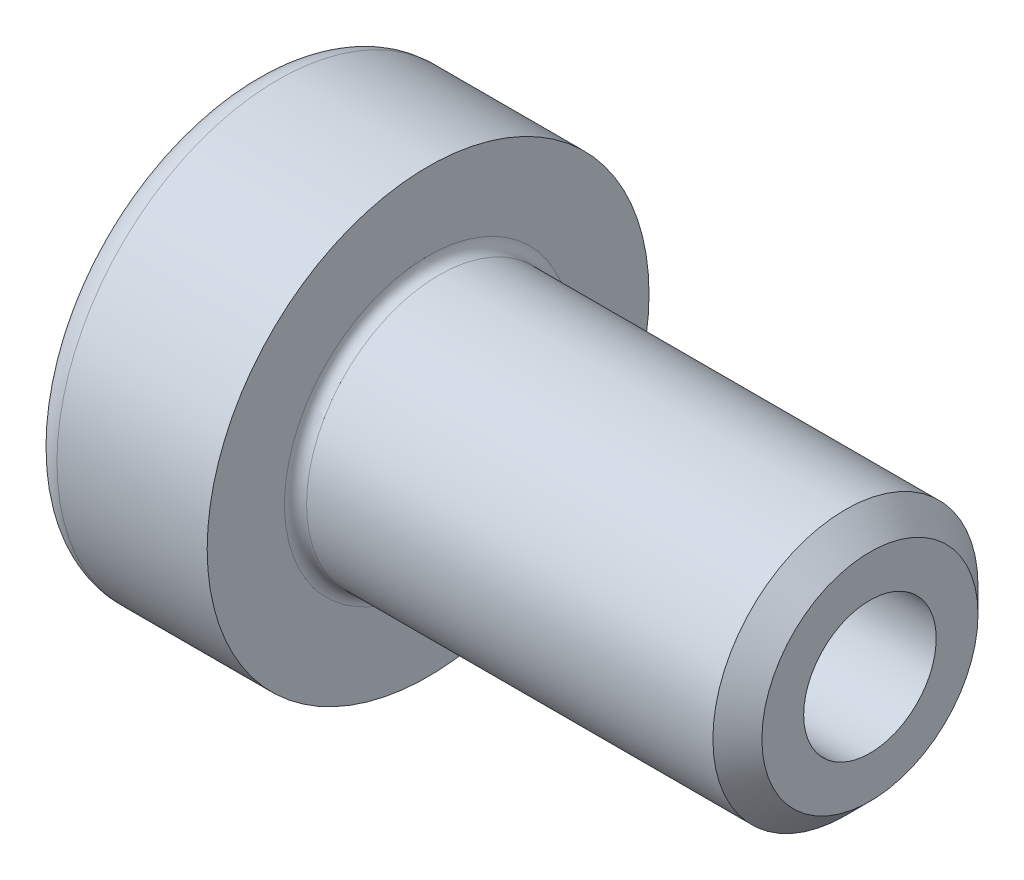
from build123d import *

# Parameters (mm, degrees)
FILLET1_R          = 0.25
FILLET2_R          = 0.6
HEX_2_DEPTH        = 2.5
SKETCH1_R          = 1.5
CUT_EXTRUDE1_DEPTH = 16.684387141


with BuildPart() as part:
    # BodySke → Base-Revolve (revolve)
    with BuildSketch(Plane.XY, mode=Mode.PRIVATE) as base_revolve_sk:
        Polygon((0, 0), (0, 5), (4, 5), (4, 3), (13.4455, 3), (14, 2.4455), (14, 0), align=None)
    revolve(base_revolve_sk.sketch.rotate(Axis((-31.75, 0, 0), (1, 0, 0)), 90), axis=Axis((-31.75, 0, 0), (1, 0, 0)))

    # Fillet1
    fillet1_edges = [part.edges().sort_by_distance(p)[0] for p in [
        (4, 0, -3),
    ]]
    fillet(fillet1_edges, radius=FILLET1_R)

    # Fillet2
    fillet2_edges = [part.edges().sort_by_distance(p)[0] for p in [
        (0, 0, -5),
    ]]
    fillet(fillet2_edges, radius=FILLET2_R)

    # HexSke → Hex 2 (cut)
    with BuildSketch(Plane(origin=(0, 0, 0), x_dir=(0, 0.500000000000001, 0.866025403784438), z_dir=(-1, 0, 0))):
        Polygon((1.443375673, 2.5), (-1.443375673, 2.5), (-2.886751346, 0), (-1.443375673, -2.5), (1.443375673, -2.5), (2.886751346, 0), align=None)
    extrude(amount=-HEX_2_DEPTH, mode=Mode.SUBTRACT)

    # PilotSke → Hex-PreBroach (revolve, cut)
    with BuildSketch(Plane.XY, mode=Mode.PRIVATE) as hex_prebroach_sk:
        Polygon((0, 2.5), (2.5, 2.5), (3.077350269, 1.5), (5, 1.5), (5.866025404, 0), (0, 0), align=None)
    revolve(hex_prebroach_sk.sketch.rotate(Axis((0, 0, 0), (1, 0, 0)), 90), axis=Axis((0, 0, 0), (1, 0, 0)), mode=Mode.SUBTRACT)

    # Sketch1 → Cut-Extrude1 (cut, through all)
    with BuildSketch(Plane.ZY):
        Circle(SKETCH1_R)
    extrude(amount=-CUT_EXTRUDE1_DEPTH, mode=Mode.SUBTRACT)


solid = part.part
